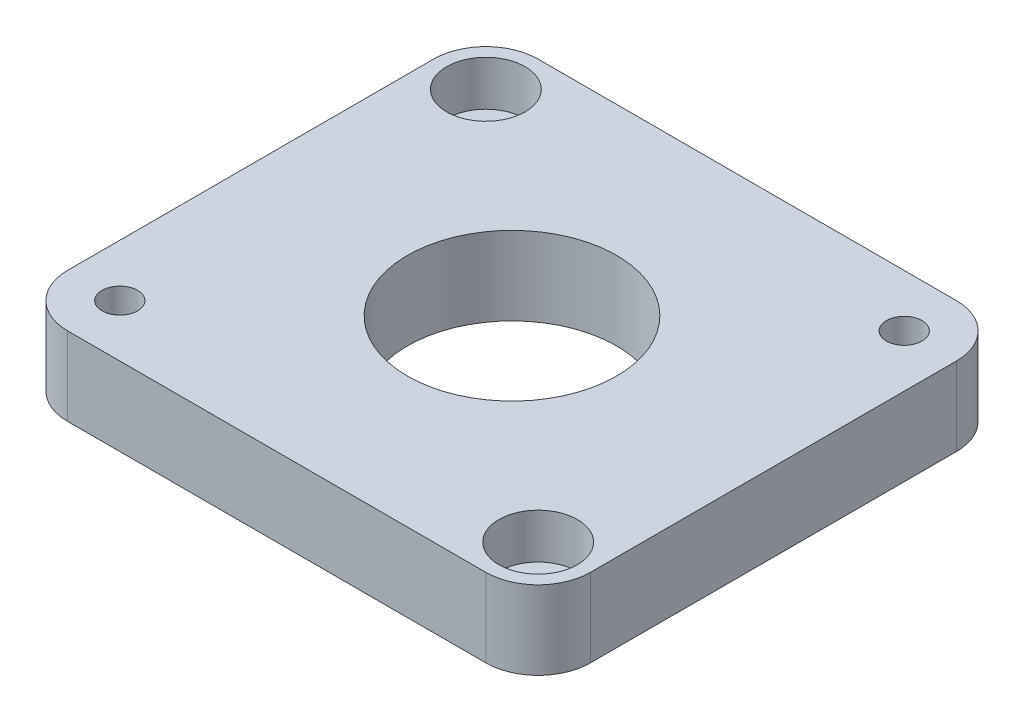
ISO-10303-21;
HEADER;
FILE_DESCRIPTION(('STEP AP214'),'2;1');
FILE_NAME('part.step','',(''),(''),'','','');
FILE_SCHEMA(('AUTOMOTIVE_DESIGN { 1 0 10303 214 1 1 1 1 }'));
ENDSEC;
DATA;
#1=APPLICATION_CONTEXT('core data for automotive mechanical design processes');
#2=APPLICATION_PROTOCOL_DEFINITION('international standard','automotive_design',2000,#1);
#3=PRODUCT_CONTEXT('',#1,'mechanical');
#4=PRODUCT('Part','Part','',(#3));
#5=PRODUCT_RELATED_PRODUCT_CATEGORY('part','',(#4));
#6=PRODUCT_DEFINITION_FORMATION('','',#4);
#7=PRODUCT_DEFINITION_CONTEXT('part definition',#1,'design');
#8=PRODUCT_DEFINITION('design','',#6,#7);
#9=PRODUCT_DEFINITION_SHAPE('','',#8);
#10=(LENGTH_UNIT() NAMED_UNIT(*) SI_UNIT(.MILLI.,.METRE.));
#11=(NAMED_UNIT(*) PLANE_ANGLE_UNIT() SI_UNIT($,.RADIAN.));
#12=(NAMED_UNIT(*) SI_UNIT($,.STERADIAN.) SOLID_ANGLE_UNIT());
#13=UNCERTAINTY_MEASURE_WITH_UNIT(LENGTH_MEASURE(1.E-05),#10,'distance_accuracy_value','');
#14=(GEOMETRIC_REPRESENTATION_CONTEXT(3) GLOBAL_UNCERTAINTY_ASSIGNED_CONTEXT((#13)) GLOBAL_UNIT_ASSIGNED_CONTEXT((#10,
#11,#12)) REPRESENTATION_CONTEXT('',''));
#15=CARTESIAN_POINT('',(0.,0.,0.));
#16=DIRECTION('',(0.,0.,1.));
#17=DIRECTION('',(1.,0.,0.));
#18=AXIS2_PLACEMENT_3D('',#15,#16,#17);
#19=CARTESIAN_POINT('',(-40.,15.,-35.));
#20=DIRECTION('',(0.,-1.,0.));
#21=DIRECTION('',(0.,0.,-1.));
#22=AXIS2_PLACEMENT_3D('',#19,#20,#21);
#23=CYLINDRICAL_SURFACE('',#22,10.);
#24=CARTESIAN_POINT('',(-40.,0.,-35.));
#25=DIRECTION('',(0.,1.,0.));
#26=DIRECTION('',(0.,0.,1.));
#27=AXIS2_PLACEMENT_3D('',#24,#25,#26);
#28=CIRCLE('',#27,10.);
#29=CARTESIAN_POINT('',(-40.,0.,-45.));
#30=VERTEX_POINT('',#29);
#31=CARTESIAN_POINT('',(-50.,0.,-34.9999999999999));
#32=VERTEX_POINT('',#31);
#33=EDGE_CURVE('E132',#30,#32,#28,.T.);
#34=ORIENTED_EDGE('',*,*,#33,.T.);
#35=DIRECTION('',(0.,-1.,0.));
#36=VECTOR('',#35,1.);
#37=CARTESIAN_POINT('',(-50.,15.,-34.9999999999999));
#38=LINE('',#37,#36);
#39=CARTESIAN_POINT('',(-50.,15.,-34.9999999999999));
#40=VERTEX_POINT('',#39);
#41=EDGE_CURVE('E11',#40,#32,#38,.T.);
#42=ORIENTED_EDGE('',*,*,#41,.F.);
#43=CARTESIAN_POINT('',(-40.,15.,-35.));
#44=DIRECTION('',(0.,1.,0.));
#45=DIRECTION('',(0.,0.,1.));
#46=AXIS2_PLACEMENT_3D('',#43,#44,#45);
#47=CIRCLE('',#46,10.);
#48=CARTESIAN_POINT('',(-40.,15.,-45.));
#49=VERTEX_POINT('',#48);
#50=EDGE_CURVE('E147',#49,#40,#47,.T.);
#51=ORIENTED_EDGE('',*,*,#50,.F.);
#52=DIRECTION('',(0.,-1.,0.));
#53=VECTOR('',#52,1.);
#54=CARTESIAN_POINT('',(-40.,15.,-45.));
#55=LINE('',#54,#53);
#56=EDGE_CURVE('E128',#49,#30,#55,.T.);
#57=ORIENTED_EDGE('',*,*,#56,.T.);
#58=EDGE_LOOP('',(#34,#42,#51,#57));
#59=FACE_BOUND('',#58,.T.);
#60=ADVANCED_FACE('F36',(#59),#23,.T.);
#61=CARTESIAN_POINT('',(-50.,15.,-34.9999999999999));
#62=DIRECTION('',(1.,0.,0.));
#63=DIRECTION('',(0.,0.,-1.));
#64=AXIS2_PLACEMENT_3D('',#61,#62,#63);
#65=PLANE('',#64);
#66=DIRECTION('',(0.,0.,1.));
#67=VECTOR('',#66,1.);
#68=CARTESIAN_POINT('',(-50.,0.,-34.9999999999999));
#69=LINE('',#68,#67);
#70=CARTESIAN_POINT('',(-50.,0.,34.9999999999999));
#71=VERTEX_POINT('',#70);
#72=EDGE_CURVE('E135',#32,#71,#69,.T.);
#73=ORIENTED_EDGE('',*,*,#72,.T.);
#74=DIRECTION('',(0.,-1.,0.));
#75=VECTOR('',#74,1.);
#76=CARTESIAN_POINT('',(-50.,15.,34.9999999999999));
#77=LINE('',#76,#75);
#78=CARTESIAN_POINT('',(-50.,15.,34.9999999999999));
#79=VERTEX_POINT('',#78);
#80=EDGE_CURVE('E44',#79,#71,#77,.T.);
#81=ORIENTED_EDGE('',*,*,#80,.F.);
#82=DIRECTION('',(0.,0.,1.));
#83=VECTOR('',#82,1.);
#84=CARTESIAN_POINT('',(-50.,15.,-34.9999999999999));
#85=LINE('',#84,#83);
#86=EDGE_CURVE('E95',#40,#79,#85,.T.);
#87=ORIENTED_EDGE('',*,*,#86,.F.);
#88=ORIENTED_EDGE('',*,*,#41,.T.);
#89=EDGE_LOOP('',(#73,#81,#87,#88));
#90=FACE_BOUND('',#89,.T.);
#91=ADVANCED_FACE('F252',(#90),#65,.F.);
#92=CARTESIAN_POINT('',(-40.,15.,35.));
#93=DIRECTION('',(0.,-1.,0.));
#94=DIRECTION('',(0.,0.,-1.));
#95=AXIS2_PLACEMENT_3D('',#92,#93,#94);
#96=CYLINDRICAL_SURFACE('',#95,10.);
#97=CARTESIAN_POINT('',(-40.,0.,35.));
#98=DIRECTION('',(0.,1.,0.));
#99=DIRECTION('',(0.,0.,1.));
#100=AXIS2_PLACEMENT_3D('',#97,#98,#99);
#101=CIRCLE('',#100,10.);
#102=CARTESIAN_POINT('',(-39.9999999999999,0.,45.));
#103=VERTEX_POINT('',#102);
#104=EDGE_CURVE('E138',#71,#103,#101,.T.);
#105=ORIENTED_EDGE('',*,*,#104,.T.);
#106=DIRECTION('',(0.,-1.,0.));
#107=VECTOR('',#106,1.);
#108=CARTESIAN_POINT('',(-39.9999999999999,15.,45.));
#109=LINE('',#108,#107);
#110=CARTESIAN_POINT('',(-39.9999999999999,15.,45.));
#111=VERTEX_POINT('',#110);
#112=EDGE_CURVE('E154',#111,#103,#109,.T.);
#113=ORIENTED_EDGE('',*,*,#112,.F.);
#114=CARTESIAN_POINT('',(-40.,15.,35.));
#115=DIRECTION('',(0.,1.,0.));
#116=DIRECTION('',(0.,0.,1.));
#117=AXIS2_PLACEMENT_3D('',#114,#115,#116);
#118=CIRCLE('',#117,10.);
#119=EDGE_CURVE('E162',#79,#111,#118,.T.);
#120=ORIENTED_EDGE('',*,*,#119,.F.);
#121=ORIENTED_EDGE('',*,*,#80,.T.);
#122=EDGE_LOOP('',(#105,#113,#120,#121));
#123=FACE_BOUND('',#122,.T.);
#124=ADVANCED_FACE('F160',(#123),#96,.T.);
#125=CARTESIAN_POINT('',(-39.9999999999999,15.,45.));
#126=DIRECTION('',(0.,0.,-1.));
#127=DIRECTION('',(-1.,0.,0.));
#128=AXIS2_PLACEMENT_3D('',#125,#126,#127);
#129=PLANE('',#128);
#130=DIRECTION('',(1.,0.,0.));
#131=VECTOR('',#130,1.);
#132=CARTESIAN_POINT('',(-39.9999999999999,0.,45.));
#133=LINE('',#132,#131);
#134=CARTESIAN_POINT('',(39.9999999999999,0.,45.));
#135=VERTEX_POINT('',#134);
#136=EDGE_CURVE('E140',#103,#135,#133,.T.);
#137=ORIENTED_EDGE('',*,*,#136,.T.);
#138=DIRECTION('',(0.,-1.,0.));
#139=VECTOR('',#138,1.);
#140=CARTESIAN_POINT('',(39.9999999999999,15.,45.));
#141=LINE('',#140,#139);
#142=CARTESIAN_POINT('',(39.9999999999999,15.,45.));
#143=VERTEX_POINT('',#142);
#144=EDGE_CURVE('E151',#143,#135,#141,.T.);
#145=ORIENTED_EDGE('',*,*,#144,.F.);
#146=DIRECTION('',(1.,0.,0.));
#147=VECTOR('',#146,1.);
#148=CARTESIAN_POINT('',(-39.9999999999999,15.,45.));
#149=LINE('',#148,#147);
#150=EDGE_CURVE('E174',#111,#143,#149,.T.);
#151=ORIENTED_EDGE('',*,*,#150,.F.);
#152=ORIENTED_EDGE('',*,*,#112,.T.);
#153=EDGE_LOOP('',(#137,#145,#151,#152));
#154=FACE_BOUND('',#153,.T.);
#155=ADVANCED_FACE('F170',(#154),#129,.F.);
#156=CARTESIAN_POINT('',(40.,15.,35.));
#157=DIRECTION('',(0.,-1.,0.));
#158=DIRECTION('',(0.,0.,-1.));
#159=AXIS2_PLACEMENT_3D('',#156,#157,#158);
#160=CYLINDRICAL_SURFACE('',#159,10.);
#161=CARTESIAN_POINT('',(40.,0.,35.));
#162=DIRECTION('',(0.,1.,0.));
#163=DIRECTION('',(0.,0.,1.));
#164=AXIS2_PLACEMENT_3D('',#161,#162,#163);
#165=CIRCLE('',#164,10.);
#166=CARTESIAN_POINT('',(50.,0.,34.9999999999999));
#167=VERTEX_POINT('',#166);
#168=EDGE_CURVE('E142',#135,#167,#165,.T.);
#169=ORIENTED_EDGE('',*,*,#168,.T.);
#170=DIRECTION('',(0.,-1.,0.));
#171=VECTOR('',#170,1.);
#172=CARTESIAN_POINT('',(50.,15.,34.9999999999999));
#173=LINE('',#172,#171);
#174=CARTESIAN_POINT('',(50.,15.,34.9999999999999));
#175=VERTEX_POINT('',#174);
#176=EDGE_CURVE('E123',#175,#167,#173,.T.);
#177=ORIENTED_EDGE('',*,*,#176,.F.);
#178=CARTESIAN_POINT('',(40.,15.,35.));
#179=DIRECTION('',(0.,1.,0.));
#180=DIRECTION('',(0.,0.,1.));
#181=AXIS2_PLACEMENT_3D('',#178,#179,#180);
#182=CIRCLE('',#181,10.);
#183=EDGE_CURVE('E114',#143,#175,#182,.T.);
#184=ORIENTED_EDGE('',*,*,#183,.F.);
#185=ORIENTED_EDGE('',*,*,#144,.T.);
#186=EDGE_LOOP('',(#169,#177,#184,#185));
#187=FACE_BOUND('',#186,.T.);
#188=ADVANCED_FACE('F173',(#187),#160,.T.);
#189=CARTESIAN_POINT('',(50.,15.,-34.9999999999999));
#190=DIRECTION('',(-1.,0.,0.));
#191=DIRECTION('',(0.,0.,1.));
#192=AXIS2_PLACEMENT_3D('',#189,#190,#191);
#193=PLANE('',#192);
#194=DIRECTION('',(0.,0.,-1.));
#195=VECTOR('',#194,1.);
#196=CARTESIAN_POINT('',(50.,0.,-34.9999999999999));
#197=LINE('',#196,#195);
#198=CARTESIAN_POINT('',(50.,0.,-34.9999999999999));
#199=VERTEX_POINT('',#198);
#200=EDGE_CURVE('E122',#167,#199,#197,.T.);
#201=ORIENTED_EDGE('',*,*,#200,.T.);
#202=DIRECTION('',(0.,-1.,0.));
#203=VECTOR('',#202,1.);
#204=CARTESIAN_POINT('',(50.,15.,-34.9999999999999));
#205=LINE('',#204,#203);
#206=CARTESIAN_POINT('',(50.,15.,-34.9999999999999));
#207=VERTEX_POINT('',#206);
#208=EDGE_CURVE('E119',#207,#199,#205,.T.);
#209=ORIENTED_EDGE('',*,*,#208,.F.);
#210=DIRECTION('',(0.,0.,-1.));
#211=VECTOR('',#210,1.);
#212=CARTESIAN_POINT('',(50.,15.,-34.9999999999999));
#213=LINE('',#212,#211);
#214=EDGE_CURVE('E108',#175,#207,#213,.T.);
#215=ORIENTED_EDGE('',*,*,#214,.F.);
#216=ORIENTED_EDGE('',*,*,#176,.T.);
#217=EDGE_LOOP('',(#201,#209,#215,#216));
#218=FACE_BOUND('',#217,.T.);
#219=ADVANCED_FACE('F120',(#218),#193,.F.);
#220=CARTESIAN_POINT('',(40.,15.,-35.));
#221=DIRECTION('',(0.,-1.,0.));
#222=DIRECTION('',(0.,0.,-1.));
#223=AXIS2_PLACEMENT_3D('',#220,#221,#222);
#224=CYLINDRICAL_SURFACE('',#223,9.99999999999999);
#225=CARTESIAN_POINT('',(40.,0.,-35.));
#226=DIRECTION('',(0.,1.,0.));
#227=DIRECTION('',(0.,0.,-1.));
#228=AXIS2_PLACEMENT_3D('',#225,#226,#227);
#229=CIRCLE('',#228,9.99999999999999);
#230=CARTESIAN_POINT('',(39.9999999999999,0.,-45.));
#231=VERTEX_POINT('',#230);
#232=EDGE_CURVE('E81',#199,#231,#229,.T.);
#233=ORIENTED_EDGE('',*,*,#232,.T.);
#234=DIRECTION('',(0.,-1.,0.));
#235=VECTOR('',#234,1.);
#236=CARTESIAN_POINT('',(39.9999999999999,15.,-45.));
#237=LINE('',#236,#235);
#238=CARTESIAN_POINT('',(39.9999999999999,15.,-45.));
#239=VERTEX_POINT('',#238);
#240=EDGE_CURVE('E124',#239,#231,#237,.T.);
#241=ORIENTED_EDGE('',*,*,#240,.F.);
#242=CARTESIAN_POINT('',(40.,15.,-35.));
#243=DIRECTION('',(0.,1.,0.));
#244=DIRECTION('',(0.,0.,-1.));
#245=AXIS2_PLACEMENT_3D('',#242,#243,#244);
#246=CIRCLE('',#245,9.99999999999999);
#247=EDGE_CURVE('E112',#207,#239,#246,.T.);
#248=ORIENTED_EDGE('',*,*,#247,.F.);
#249=ORIENTED_EDGE('',*,*,#208,.T.);
#250=EDGE_LOOP('',(#233,#241,#248,#249));
#251=FACE_BOUND('',#250,.T.);
#252=ADVANCED_FACE('F126',(#251),#224,.T.);
#253=CARTESIAN_POINT('',(-40.,15.,-45.));
#254=DIRECTION('',(0.,0.,1.));
#255=DIRECTION('',(1.,0.,0.));
#256=AXIS2_PLACEMENT_3D('',#253,#254,#255);
#257=PLANE('',#256);
#258=DIRECTION('',(-1.,0.,0.));
#259=VECTOR('',#258,1.);
#260=CARTESIAN_POINT('',(-40.,0.,-45.));
#261=LINE('',#260,#259);
#262=EDGE_CURVE('E87',#231,#30,#261,.T.);
#263=ORIENTED_EDGE('',*,*,#262,.T.);
#264=ORIENTED_EDGE('',*,*,#56,.F.);
#265=DIRECTION('',(-1.,0.,0.));
#266=VECTOR('',#265,1.);
#267=CARTESIAN_POINT('',(-40.,15.,-45.));
#268=LINE('',#267,#266);
#269=EDGE_CURVE('E52',#239,#49,#268,.T.);
#270=ORIENTED_EDGE('',*,*,#269,.F.);
#271=ORIENTED_EDGE('',*,*,#240,.T.);
#272=EDGE_LOOP('',(#263,#264,#270,#271));
#273=FACE_BOUND('',#272,.T.);
#274=ADVANCED_FACE('F226',(#273),#257,.F.);
#275=CARTESIAN_POINT('',(-40.,15.,-35.));
#276=DIRECTION('',(0.,1.,0.));
#277=DIRECTION('',(0.,0.,1.));
#278=AXIS2_PLACEMENT_3D('',#275,#276,#277);
#279=PLANE('',#278);
#280=CARTESIAN_POINT('',(40.,15.,-35.));
#281=DIRECTION('',(0.,1.,0.));
#282=DIRECTION('',(0.,0.,1.));
#283=AXIS2_PLACEMENT_3D('',#280,#281,#282);
#284=CIRCLE('',#283,3.4);
#285=CARTESIAN_POINT('',(40.,15.,-31.6));
#286=VERTEX_POINT('',#285);
#287=EDGE_CURVE('E218',#286,#286,#284,.T.);
#288=ORIENTED_EDGE('',*,*,#287,.F.);
#289=EDGE_LOOP('',(#288));
#290=FACE_BOUND('',#289,.T.);
#291=CARTESIAN_POINT('',(-40.,15.,35.));
#292=DIRECTION('',(0.,1.,0.));
#293=DIRECTION('',(0.,0.,1.));
#294=AXIS2_PLACEMENT_3D('',#291,#292,#293);
#295=CIRCLE('',#294,3.4);
#296=CARTESIAN_POINT('',(-40.,15.,38.4));
#297=VERTEX_POINT('',#296);
#298=EDGE_CURVE('E212',#297,#297,#295,.T.);
#299=ORIENTED_EDGE('',*,*,#298,.F.);
#300=EDGE_LOOP('',(#299));
#301=FACE_BOUND('',#300,.T.);
#302=CARTESIAN_POINT('',(-40.,15.,-35.));
#303=DIRECTION('',(0.,1.,0.));
#304=DIRECTION('',(0.,0.,1.));
#305=AXIS2_PLACEMENT_3D('',#302,#303,#304);
#306=CIRCLE('',#305,7.49999999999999);
#307=CARTESIAN_POINT('',(-40.,15.,-27.5));
#308=VERTEX_POINT('',#307);
#309=EDGE_CURVE('E206',#308,#308,#306,.T.);
#310=ORIENTED_EDGE('',*,*,#309,.F.);
#311=EDGE_LOOP('',(#310));
#312=FACE_BOUND('',#311,.T.);
#313=CARTESIAN_POINT('',(40.,15.,35.));
#314=DIRECTION('',(0.,1.,0.));
#315=DIRECTION('',(0.,0.,1.));
#316=AXIS2_PLACEMENT_3D('',#313,#314,#315);
#317=CIRCLE('',#316,7.49999999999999);
#318=CARTESIAN_POINT('',(40.,15.,42.5));
#319=VERTEX_POINT('',#318);
#320=EDGE_CURVE('E194',#319,#319,#317,.T.);
#321=ORIENTED_EDGE('',*,*,#320,.F.);
#322=EDGE_LOOP('',(#321));
#323=FACE_BOUND('',#322,.T.);
#324=CARTESIAN_POINT('',(0.,15.,0.));
#325=DIRECTION('',(0.,1.,0.));
#326=DIRECTION('',(0.,0.,1.));
#327=AXIS2_PLACEMENT_3D('',#324,#325,#326);
#328=CIRCLE('',#327,20.);
#329=CARTESIAN_POINT('',(0.,15.,20.));
#330=VERTEX_POINT('',#329);
#331=EDGE_CURVE('E180',#330,#330,#328,.T.);
#332=ORIENTED_EDGE('',*,*,#331,.F.);
#333=EDGE_LOOP('',(#332));
#334=FACE_BOUND('',#333,.T.);
#335=ORIENTED_EDGE('',*,*,#50,.T.);
#336=ORIENTED_EDGE('',*,*,#86,.T.);
#337=ORIENTED_EDGE('',*,*,#119,.T.);
#338=ORIENTED_EDGE('',*,*,#150,.T.);
#339=ORIENTED_EDGE('',*,*,#183,.T.);
#340=ORIENTED_EDGE('',*,*,#214,.T.);
#341=ORIENTED_EDGE('',*,*,#247,.T.);
#342=ORIENTED_EDGE('',*,*,#269,.T.);
#343=EDGE_LOOP('',(#335,#336,#337,#338,#339,#340,#341,#342));
#344=FACE_BOUND('',#343,.T.);
#345=ADVANCED_FACE('F110',(#290,#301,#312,#323,#334,#344),#279,.T.);
#346=CARTESIAN_POINT('',(-40.,0.,-35.));
#347=DIRECTION('',(0.,1.,0.));
#348=DIRECTION('',(0.,0.,1.));
#349=AXIS2_PLACEMENT_3D('',#346,#347,#348);
#350=PLANE('',#349);
#351=CARTESIAN_POINT('',(40.,0.,-35.));
#352=DIRECTION('',(0.,1.,0.));
#353=DIRECTION('',(0.,0.,1.));
#354=AXIS2_PLACEMENT_3D('',#351,#352,#353);
#355=CIRCLE('',#354,3.4);
#356=CARTESIAN_POINT('',(40.,0.,-31.6));
#357=VERTEX_POINT('',#356);
#358=EDGE_CURVE('E215',#357,#357,#355,.T.);
#359=ORIENTED_EDGE('',*,*,#358,.T.);
#360=EDGE_LOOP('',(#359));
#361=FACE_BOUND('',#360,.T.);
#362=CARTESIAN_POINT('',(-40.,0.,35.));
#363=DIRECTION('',(0.,1.,0.));
#364=DIRECTION('',(0.,0.,1.));
#365=AXIS2_PLACEMENT_3D('',#362,#363,#364);
#366=CIRCLE('',#365,3.4);
#367=CARTESIAN_POINT('',(-40.,0.,38.4));
#368=VERTEX_POINT('',#367);
#369=EDGE_CURVE('E209',#368,#368,#366,.T.);
#370=ORIENTED_EDGE('',*,*,#369,.T.);
#371=EDGE_LOOP('',(#370));
#372=FACE_BOUND('',#371,.T.);
#373=CARTESIAN_POINT('',(-40.,0.,-35.));
#374=DIRECTION('',(0.,1.,0.));
#375=DIRECTION('',(0.,0.,1.));
#376=AXIS2_PLACEMENT_3D('',#373,#374,#375);
#377=CIRCLE('',#376,4.5);
#378=CARTESIAN_POINT('',(-40.,0.,-30.5));
#379=VERTEX_POINT('',#378);
#380=EDGE_CURVE('E197',#379,#379,#377,.T.);
#381=ORIENTED_EDGE('',*,*,#380,.T.);
#382=EDGE_LOOP('',(#381));
#383=FACE_BOUND('',#382,.T.);
#384=CARTESIAN_POINT('',(40.,0.,35.));
#385=DIRECTION('',(0.,1.,0.));
#386=DIRECTION('',(0.,0.,1.));
#387=AXIS2_PLACEMENT_3D('',#384,#385,#386);
#388=CIRCLE('',#387,4.5);
#389=CARTESIAN_POINT('',(40.,0.,39.5));
#390=VERTEX_POINT('',#389);
#391=EDGE_CURVE('E183',#390,#390,#388,.T.);
#392=ORIENTED_EDGE('',*,*,#391,.T.);
#393=EDGE_LOOP('',(#392));
#394=FACE_BOUND('',#393,.T.);
#395=CARTESIAN_POINT('',(0.,0.,0.));
#396=DIRECTION('',(0.,1.,0.));
#397=DIRECTION('',(0.,0.,1.));
#398=AXIS2_PLACEMENT_3D('',#395,#396,#397);
#399=CIRCLE('',#398,20.);
#400=CARTESIAN_POINT('',(0.,0.,20.));
#401=VERTEX_POINT('',#400);
#402=EDGE_CURVE('E136',#401,#401,#399,.T.);
#403=ORIENTED_EDGE('',*,*,#402,.T.);
#404=EDGE_LOOP('',(#403));
#405=FACE_BOUND('',#404,.T.);
#406=ORIENTED_EDGE('',*,*,#33,.F.);
#407=ORIENTED_EDGE('',*,*,#262,.F.);
#408=ORIENTED_EDGE('',*,*,#232,.F.);
#409=ORIENTED_EDGE('',*,*,#200,.F.);
#410=ORIENTED_EDGE('',*,*,#168,.F.);
#411=ORIENTED_EDGE('',*,*,#136,.F.);
#412=ORIENTED_EDGE('',*,*,#104,.F.);
#413=ORIENTED_EDGE('',*,*,#72,.F.);
#414=EDGE_LOOP('',(#406,#407,#408,#409,#410,#411,#412,#413));
#415=FACE_BOUND('',#414,.T.);
#416=ADVANCED_FACE('F166',(#361,#372,#383,#394,#405,#415),#350,.F.);
#417=CARTESIAN_POINT('',(0.,0.,0.));
#418=DIRECTION('',(0.,1.,0.));
#419=DIRECTION('',(0.,0.,1.));
#420=AXIS2_PLACEMENT_3D('',#417,#418,#419);
#421=CYLINDRICAL_SURFACE('',#420,20.);
#422=ORIENTED_EDGE('',*,*,#402,.F.);
#423=EDGE_LOOP('',(#422));
#424=FACE_BOUND('',#423,.T.);
#425=ORIENTED_EDGE('',*,*,#331,.T.);
#426=EDGE_LOOP('',(#425));
#427=FACE_BOUND('',#426,.T.);
#428=ADVANCED_FACE('F236',(#424,#427),#421,.F.);
#429=CARTESIAN_POINT('',(40.,15.,35.));
#430=DIRECTION('',(0.,1.,0.));
#431=DIRECTION('',(0.,0.,1.));
#432=AXIS2_PLACEMENT_3D('',#429,#430,#431);
#433=CYLINDRICAL_SURFACE('',#432,4.5);
#434=ORIENTED_EDGE('',*,*,#391,.F.);
#435=EDGE_LOOP('',(#434));
#436=FACE_BOUND('',#435,.T.);
#437=CARTESIAN_POINT('',(40.,6.4,35.));
#438=DIRECTION('',(0.,1.,0.));
#439=DIRECTION('',(0.,0.,1.));
#440=AXIS2_PLACEMENT_3D('',#437,#438,#439);
#441=CIRCLE('',#440,4.50000000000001);
#442=CARTESIAN_POINT('',(40.,6.4,39.5));
#443=VERTEX_POINT('',#442);
#444=EDGE_CURVE('E188',#443,#443,#441,.T.);
#445=ORIENTED_EDGE('',*,*,#444,.T.);
#446=EDGE_LOOP('',(#445));
#447=FACE_BOUND('',#446,.T.);
#448=ADVANCED_FACE('F238',(#436,#447),#433,.F.);
#449=CARTESIAN_POINT('',(44.5,6.4,35.));
#450=DIRECTION('',(0.,-1.,0.));
#451=DIRECTION('',(0.,0.,-1.));
#452=AXIS2_PLACEMENT_3D('',#449,#450,#451);
#453=PLANE('',#452);
#454=ORIENTED_EDGE('',*,*,#444,.F.);
#455=EDGE_LOOP('',(#454));
#456=FACE_BOUND('',#455,.T.);
#457=CARTESIAN_POINT('',(40.,6.4,35.));
#458=DIRECTION('',(0.,1.,0.));
#459=DIRECTION('',(0.,0.,1.));
#460=AXIS2_PLACEMENT_3D('',#457,#458,#459);
#461=CIRCLE('',#460,7.49999999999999);
#462=CARTESIAN_POINT('',(40.,6.4,42.5));
#463=VERTEX_POINT('',#462);
#464=EDGE_CURVE('E191',#463,#463,#461,.T.);
#465=ORIENTED_EDGE('',*,*,#464,.T.);
#466=EDGE_LOOP('',(#465));
#467=FACE_BOUND('',#466,.T.);
#468=ADVANCED_FACE('F245',(#456,#467),#453,.F.);
#469=CARTESIAN_POINT('',(40.,15.,35.));
#470=DIRECTION('',(0.,1.,0.));
#471=DIRECTION('',(0.,0.,1.));
#472=AXIS2_PLACEMENT_3D('',#469,#470,#471);
#473=CYLINDRICAL_SURFACE('',#472,7.49999999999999);
#474=ORIENTED_EDGE('',*,*,#464,.F.);
#475=EDGE_LOOP('',(#474));
#476=FACE_BOUND('',#475,.T.);
#477=ORIENTED_EDGE('',*,*,#320,.T.);
#478=EDGE_LOOP('',(#477));
#479=FACE_BOUND('',#478,.T.);
#480=ADVANCED_FACE('F318',(#476,#479),#473,.F.);
#481=CARTESIAN_POINT('',(-40.,15.,-35.));
#482=DIRECTION('',(0.,1.,0.));
#483=DIRECTION('',(0.,0.,1.));
#484=AXIS2_PLACEMENT_3D('',#481,#482,#483);
#485=CYLINDRICAL_SURFACE('',#484,4.5);
#486=ORIENTED_EDGE('',*,*,#380,.F.);
#487=EDGE_LOOP('',(#486));
#488=FACE_BOUND('',#487,.T.);
#489=CARTESIAN_POINT('',(-40.,6.4,-35.));
#490=DIRECTION('',(0.,1.,0.));
#491=DIRECTION('',(0.,0.,1.));
#492=AXIS2_PLACEMENT_3D('',#489,#490,#491);
#493=CIRCLE('',#492,4.50000000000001);
#494=CARTESIAN_POINT('',(-40.,6.4,-30.5));
#495=VERTEX_POINT('',#494);
#496=EDGE_CURVE('E200',#495,#495,#493,.T.);
#497=ORIENTED_EDGE('',*,*,#496,.T.);
#498=EDGE_LOOP('',(#497));
#499=FACE_BOUND('',#498,.T.);
#500=ADVANCED_FACE('F328',(#488,#499),#485,.F.);
#501=CARTESIAN_POINT('',(-35.5,6.4,-35.));
#502=DIRECTION('',(0.,-1.,0.));
#503=DIRECTION('',(0.,0.,-1.));
#504=AXIS2_PLACEMENT_3D('',#501,#502,#503);
#505=PLANE('',#504);
#506=ORIENTED_EDGE('',*,*,#496,.F.);
#507=EDGE_LOOP('',(#506));
#508=FACE_BOUND('',#507,.T.);
#509=CARTESIAN_POINT('',(-40.,6.4,-35.));
#510=DIRECTION('',(0.,1.,0.));
#511=DIRECTION('',(0.,0.,1.));
#512=AXIS2_PLACEMENT_3D('',#509,#510,#511);
#513=CIRCLE('',#512,7.49999999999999);
#514=CARTESIAN_POINT('',(-40.,6.4,-27.5));
#515=VERTEX_POINT('',#514);
#516=EDGE_CURVE('E203',#515,#515,#513,.T.);
#517=ORIENTED_EDGE('',*,*,#516,.T.);
#518=EDGE_LOOP('',(#517));
#519=FACE_BOUND('',#518,.T.);
#520=ADVANCED_FACE('F338',(#508,#519),#505,.F.);
#521=CARTESIAN_POINT('',(-40.,15.,-35.));
#522=DIRECTION('',(0.,1.,0.));
#523=DIRECTION('',(0.,0.,1.));
#524=AXIS2_PLACEMENT_3D('',#521,#522,#523);
#525=CYLINDRICAL_SURFACE('',#524,7.49999999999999);
#526=ORIENTED_EDGE('',*,*,#516,.F.);
#527=EDGE_LOOP('',(#526));
#528=FACE_BOUND('',#527,.T.);
#529=ORIENTED_EDGE('',*,*,#309,.T.);
#530=EDGE_LOOP('',(#529));
#531=FACE_BOUND('',#530,.T.);
#532=ADVANCED_FACE('F348',(#528,#531),#525,.F.);
#533=CARTESIAN_POINT('',(-40.,15.,35.));
#534=DIRECTION('',(0.,1.,0.));
#535=DIRECTION('',(0.,0.,1.));
#536=AXIS2_PLACEMENT_3D('',#533,#534,#535);
#537=CYLINDRICAL_SURFACE('',#536,3.4);
#538=ORIENTED_EDGE('',*,*,#369,.F.);
#539=EDGE_LOOP('',(#538));
#540=FACE_BOUND('',#539,.T.);
#541=ORIENTED_EDGE('',*,*,#298,.T.);
#542=EDGE_LOOP('',(#541));
#543=FACE_BOUND('',#542,.T.);
#544=ADVANCED_FACE('F358',(#540,#543),#537,.F.);
#545=CARTESIAN_POINT('',(40.,15.,-35.));
#546=DIRECTION('',(0.,1.,0.));
#547=DIRECTION('',(0.,0.,1.));
#548=AXIS2_PLACEMENT_3D('',#545,#546,#547);
#549=CYLINDRICAL_SURFACE('',#548,3.4);
#550=ORIENTED_EDGE('',*,*,#358,.F.);
#551=EDGE_LOOP('',(#550));
#552=FACE_BOUND('',#551,.T.);
#553=ORIENTED_EDGE('',*,*,#287,.T.);
#554=EDGE_LOOP('',(#553));
#555=FACE_BOUND('',#554,.T.);
#556=ADVANCED_FACE('F222',(#552,#555),#549,.F.);
#557=CLOSED_SHELL('',(#60,#91,#124,#155,#188,#219,#252,#274,#345,#416,#428,#448,#468,#480,#500,
#520,#532,#544,#556));
#558=MANIFOLD_SOLID_BREP('B2',#557);
#559=ADVANCED_BREP_SHAPE_REPRESENTATION('',(#18,#558),#14);
#560=SHAPE_DEFINITION_REPRESENTATION(#9,#559);
ENDSEC;
END-ISO-10303-21;
